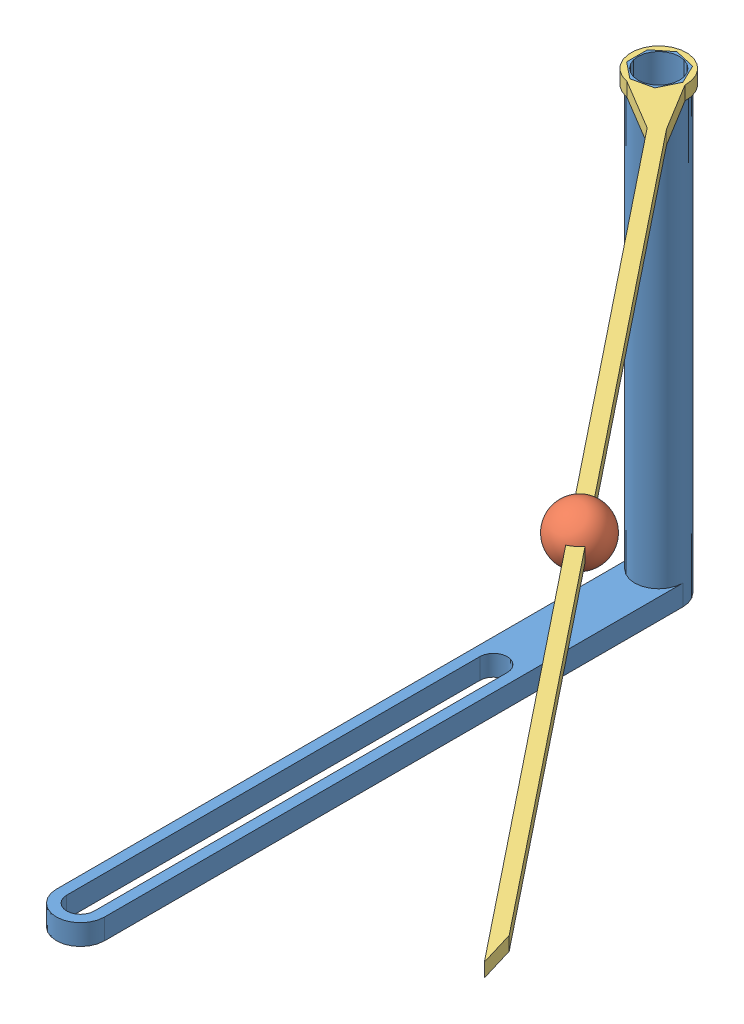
SolidWorks assembly Pointer Assembly Venus.SLDASM, configuration Default (file format 6000). Lengths in mm.
Overall size (54.25 34.5 66.6).
3 component instances, 3 part files, 6 mates.
Components (placement in the parent):
- Rod Venus-1: Rod Venus.SLDPRT [Default] at (-45.2118 -20.7273 5.7296) size (3.5 33 45.5)
- Orb Venus-1: Orb Venus.SLDPRT [Default] at (-19.3829 11.7727 37.3162) x (-0.781831 0 0.62349) z (0.62349 0 0.781831) size (4 4 3.87)
- Pointer Venus-1: Pointer Venus.SLDPRT [Default] at (-45.2118 11.2727 5.7296) x (0.62349 0 0.781831) z (-0.781831 0 0.62349) size (82 1 4)
Mates (geometry in assembly coordinates):
- Coincident1: coincident aligned: plane of Rod Venus-1 through (-45.2118 12.2727 5.7296) normal (0 1 0); plane of Pointer Venus-1 through (-45.2118 12.2727 5.7296) normal (0 1 0)
- Concentric1: concentric aligned: cylinder of Rod Venus-1 through (-45.2118 12.2727 5.7296) axis (0 -1 0) radius 1.5; cylinder of Pointer Venus-1 through (-45.2118 12.2727 5.7296) axis (0 -1 0) radius 2
- Coincident2: coincident anti-aligned: plane of Rod Venus-1 through (-43.7913 11.2727 6.4138) normal (0.900969 0 0.433884); plane of Pointer Venus-1 through (-44.1207 12.2727 7.0979) normal (-0.900969 0 -0.433884)
- Coincident3: coincident anti-aligned: plane of Orb Venus-1 through (-20.2396 12.2727 35.44) normal (0 -1 0); plane of Pointer Venus-1 through (-45.2118 12.2727 5.7296) normal (0 1 0)
- Coincident4: coincident anti-aligned: plane of Orb Venus-1 through (-21.0214 12.2727 36.0635) normal (0.781831 0 -0.62349); plane of Pointer Venus-1 through (-41.8931 12.2727 9.8912) normal (-0.781831 0 0.62349)
- Coincident6: coincident: point of Orb Venus-1; point of Pointer Venus-1
